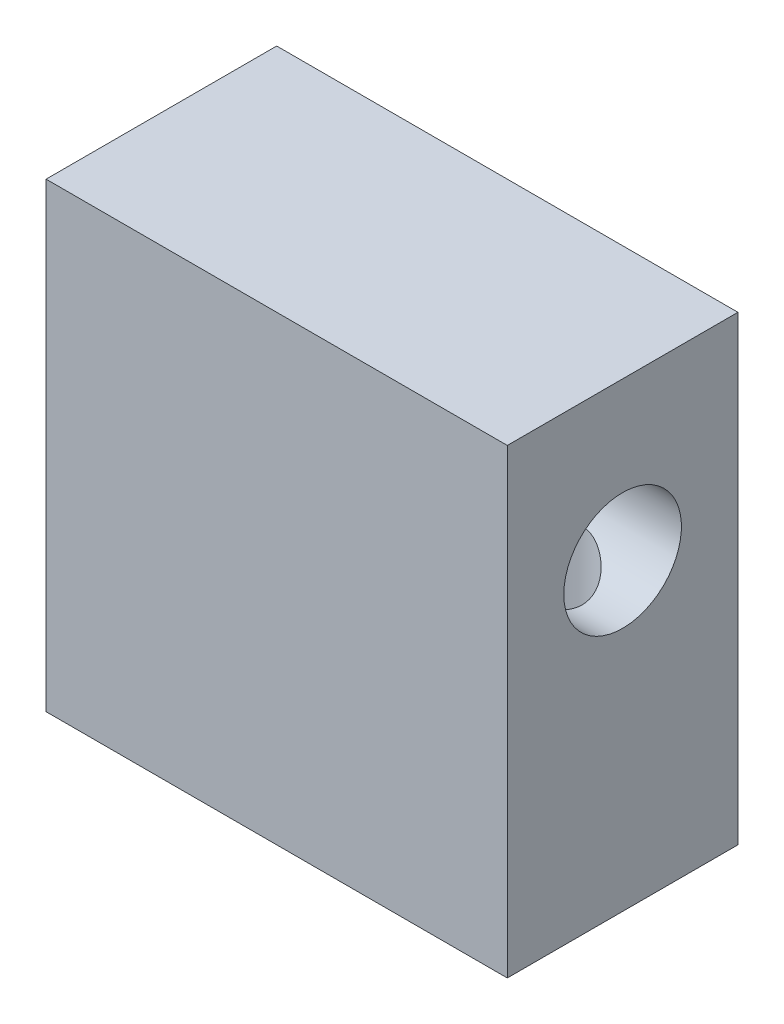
ISO-10303-21;
HEADER;
FILE_DESCRIPTION(('STEP AP214'),'2;1');
FILE_NAME('part.step','',(''),(''),'','','');
FILE_SCHEMA(('AUTOMOTIVE_DESIGN { 1 0 10303 214 1 1 1 1 }'));
ENDSEC;
DATA;
#1=APPLICATION_CONTEXT('core data for automotive mechanical design processes');
#2=APPLICATION_PROTOCOL_DEFINITION('international standard','automotive_design',2000,#1);
#3=PRODUCT_CONTEXT('',#1,'mechanical');
#4=PRODUCT('Part','Part','',(#3));
#5=PRODUCT_RELATED_PRODUCT_CATEGORY('part','',(#4));
#6=PRODUCT_DEFINITION_FORMATION('','',#4);
#7=PRODUCT_DEFINITION_CONTEXT('part definition',#1,'design');
#8=PRODUCT_DEFINITION('design','',#6,#7);
#9=PRODUCT_DEFINITION_SHAPE('','',#8);
#10=(LENGTH_UNIT() NAMED_UNIT(*) SI_UNIT(.MILLI.,.METRE.));
#11=(NAMED_UNIT(*) PLANE_ANGLE_UNIT() SI_UNIT($,.RADIAN.));
#12=(NAMED_UNIT(*) SI_UNIT($,.STERADIAN.) SOLID_ANGLE_UNIT());
#13=UNCERTAINTY_MEASURE_WITH_UNIT(LENGTH_MEASURE(1.E-05),#10,'distance_accuracy_value','');
#14=(GEOMETRIC_REPRESENTATION_CONTEXT(3) GLOBAL_UNCERTAINTY_ASSIGNED_CONTEXT((#13)) GLOBAL_UNIT_ASSIGNED_CONTEXT((#10,
#11,#12)) REPRESENTATION_CONTEXT('',''));
#15=CARTESIAN_POINT('',(0.,0.,0.));
#16=DIRECTION('',(0.,0.,1.));
#17=DIRECTION('',(1.,0.,0.));
#18=AXIS2_PLACEMENT_3D('',#15,#16,#17);
#19=CARTESIAN_POINT('',(0.,0.,12.7));
#20=DIRECTION('',(-1.,0.,0.));
#21=DIRECTION('',(0.,0.,1.));
#22=AXIS2_PLACEMENT_3D('',#19,#20,#21);
#23=PLANE('',#22);
#24=CARTESIAN_POINT('',(0.,16.7386,6.35));
#25=DIRECTION('',(-1.,0.,0.));
#26=DIRECTION('',(0.,0.,1.));
#27=AXIS2_PLACEMENT_3D('',#24,#25,#26);
#28=CIRCLE('',#27,3.2385);
#29=CARTESIAN_POINT('',(0.,16.7386,9.5885));
#30=VERTEX_POINT('',#29);
#31=EDGE_CURVE('E143',#30,#30,#28,.T.);
#32=ORIENTED_EDGE('',*,*,#31,.F.);
#33=EDGE_LOOP('',(#32));
#34=FACE_BOUND('',#33,.T.);
#35=DIRECTION('',(0.,0.,-1.));
#36=VECTOR('',#35,1.);
#37=CARTESIAN_POINT('',(0.,0.,12.7));
#38=LINE('',#37,#36);
#39=CARTESIAN_POINT('',(0.,0.,12.7));
#40=VERTEX_POINT('',#39);
#41=CARTESIAN_POINT('',(0.,0.,0.));
#42=VERTEX_POINT('',#41);
#43=EDGE_CURVE('E182',#40,#42,#38,.T.);
#44=ORIENTED_EDGE('',*,*,#43,.F.);
#45=DIRECTION('',(0.,1.,0.));
#46=VECTOR('',#45,1.);
#47=CARTESIAN_POINT('',(0.,0.,12.7));
#48=LINE('',#47,#46);
#49=CARTESIAN_POINT('',(0.,25.4,12.7));
#50=VERTEX_POINT('',#49);
#51=EDGE_CURVE('E164',#40,#50,#48,.T.);
#52=ORIENTED_EDGE('',*,*,#51,.T.);
#53=DIRECTION('',(0.,0.,-1.));
#54=VECTOR('',#53,1.);
#55=CARTESIAN_POINT('',(0.,25.4,12.7));
#56=LINE('',#55,#54);
#57=CARTESIAN_POINT('',(0.,25.4,0.));
#58=VERTEX_POINT('',#57);
#59=EDGE_CURVE('E176',#50,#58,#56,.T.);
#60=ORIENTED_EDGE('',*,*,#59,.T.);
#61=DIRECTION('',(0.,1.,0.));
#62=VECTOR('',#61,1.);
#63=CARTESIAN_POINT('',(0.,0.,0.));
#64=LINE('',#63,#62);
#65=EDGE_CURVE('E146',#42,#58,#64,.T.);
#66=ORIENTED_EDGE('',*,*,#65,.F.);
#67=EDGE_LOOP('',(#44,#52,#60,#66));
#68=FACE_BOUND('',#67,.T.);
#69=ADVANCED_FACE('F39',(#34,#68),#23,.T.);
#70=CARTESIAN_POINT('',(0.,0.,12.7));
#71=DIRECTION('',(0.,1.,0.));
#72=DIRECTION('',(-1.,0.,0.));
#73=AXIS2_PLACEMENT_3D('',#70,#71,#72);
#74=PLANE('',#73);
#75=CARTESIAN_POINT('',(20.6248,0.,6.35));
#76=DIRECTION('',(0.,-1.,0.));
#77=DIRECTION('',(1.,0.,0.));
#78=AXIS2_PLACEMENT_3D('',#75,#76,#77);
#79=CIRCLE('',#78,2.54);
#80=CARTESIAN_POINT('',(23.1648,0.,6.35));
#81=VERTEX_POINT('',#80);
#82=EDGE_CURVE('E354',#81,#81,#79,.T.);
#83=ORIENTED_EDGE('',*,*,#82,.F.);
#84=EDGE_LOOP('',(#83));
#85=FACE_BOUND('',#84,.T.);
#86=CARTESIAN_POINT('',(4.7498,0.,6.35));
#87=DIRECTION('',(0.,-1.,0.));
#88=DIRECTION('',(1.,0.,0.));
#89=AXIS2_PLACEMENT_3D('',#86,#87,#88);
#90=CIRCLE('',#89,2.54);
#91=CARTESIAN_POINT('',(7.2898,0.,6.35));
#92=VERTEX_POINT('',#91);
#93=EDGE_CURVE('E357',#92,#92,#90,.T.);
#94=ORIENTED_EDGE('',*,*,#93,.F.);
#95=EDGE_LOOP('',(#94));
#96=FACE_BOUND('',#95,.T.);
#97=DIRECTION('',(0.,0.,-1.));
#98=VECTOR('',#97,1.);
#99=CARTESIAN_POINT('',(25.4,0.,12.7));
#100=LINE('',#99,#98);
#101=CARTESIAN_POINT('',(25.4,0.,12.7));
#102=VERTEX_POINT('',#101);
#103=CARTESIAN_POINT('',(25.4,0.,0.));
#104=VERTEX_POINT('',#103);
#105=EDGE_CURVE('E180',#102,#104,#100,.T.);
#106=ORIENTED_EDGE('',*,*,#105,.F.);
#107=DIRECTION('',(1.,0.,0.));
#108=VECTOR('',#107,1.);
#109=CARTESIAN_POINT('',(0.,0.,12.7));
#110=LINE('',#109,#108);
#111=EDGE_CURVE('E173',#40,#102,#110,.T.);
#112=ORIENTED_EDGE('',*,*,#111,.F.);
#113=ORIENTED_EDGE('',*,*,#43,.T.);
#114=DIRECTION('',(1.,0.,0.));
#115=VECTOR('',#114,1.);
#116=CARTESIAN_POINT('',(0.,0.,0.));
#117=LINE('',#116,#115);
#118=EDGE_CURVE('E161',#42,#104,#117,.T.);
#119=ORIENTED_EDGE('',*,*,#118,.T.);
#120=EDGE_LOOP('',(#106,#112,#113,#119));
#121=FACE_BOUND('',#120,.T.);
#122=ADVANCED_FACE('F41',(#85,#96,#121),#74,.F.);
#123=CARTESIAN_POINT('',(25.4,25.4,12.7));
#124=DIRECTION('',(1.,0.,0.));
#125=DIRECTION('',(0.,0.,-1.));
#126=AXIS2_PLACEMENT_3D('',#123,#124,#125);
#127=PLANE('',#126);
#128=CARTESIAN_POINT('',(25.4,16.7386,6.35));
#129=DIRECTION('',(-1.,0.,0.));
#130=DIRECTION('',(0.,0.,1.));
#131=AXIS2_PLACEMENT_3D('',#128,#129,#130);
#132=CIRCLE('',#131,3.2385);
#133=CARTESIAN_POINT('',(25.4,16.7386,9.5885));
#134=VERTEX_POINT('',#133);
#135=EDGE_CURVE('E140',#134,#134,#132,.T.);
#136=ORIENTED_EDGE('',*,*,#135,.T.);
#137=EDGE_LOOP('',(#136));
#138=FACE_BOUND('',#137,.T.);
#139=DIRECTION('',(0.,0.,-1.));
#140=VECTOR('',#139,1.);
#141=CARTESIAN_POINT('',(25.4,25.4,12.7));
#142=LINE('',#141,#140);
#143=CARTESIAN_POINT('',(25.4,25.4,12.7));
#144=VERTEX_POINT('',#143);
#145=CARTESIAN_POINT('',(25.4,25.4,0.));
#146=VERTEX_POINT('',#145);
#147=EDGE_CURVE('E178',#144,#146,#142,.T.);
#148=ORIENTED_EDGE('',*,*,#147,.F.);
#149=DIRECTION('',(0.,-1.,0.));
#150=VECTOR('',#149,1.);
#151=CARTESIAN_POINT('',(25.4,25.4,12.7));
#152=LINE('',#151,#150);
#153=EDGE_CURVE('E170',#144,#102,#152,.T.);
#154=ORIENTED_EDGE('',*,*,#153,.T.);
#155=ORIENTED_EDGE('',*,*,#105,.T.);
#156=DIRECTION('',(0.,-1.,0.));
#157=VECTOR('',#156,1.);
#158=CARTESIAN_POINT('',(25.4,25.4,0.));
#159=LINE('',#158,#157);
#160=EDGE_CURVE('E158',#146,#104,#159,.T.);
#161=ORIENTED_EDGE('',*,*,#160,.F.);
#162=EDGE_LOOP('',(#148,#154,#155,#161));
#163=FACE_BOUND('',#162,.T.);
#164=ADVANCED_FACE('F228',(#138,#163),#127,.T.);
#165=CARTESIAN_POINT('',(25.4,25.4,12.7));
#166=DIRECTION('',(0.,-1.,0.));
#167=DIRECTION('',(1.,0.,0.));
#168=AXIS2_PLACEMENT_3D('',#165,#166,#167);
#169=PLANE('',#168);
#170=DIRECTION('',(-1.,0.,0.));
#171=VECTOR('',#170,1.);
#172=CARTESIAN_POINT('',(25.4,25.4,12.7));
#173=LINE('',#172,#171);
#174=EDGE_CURVE('E167',#144,#50,#173,.T.);
#175=ORIENTED_EDGE('',*,*,#174,.F.);
#176=ORIENTED_EDGE('',*,*,#147,.T.);
#177=DIRECTION('',(-1.,0.,0.));
#178=VECTOR('',#177,1.);
#179=CARTESIAN_POINT('',(25.4,25.4,0.));
#180=LINE('',#179,#178);
#181=EDGE_CURVE('E155',#146,#58,#180,.T.);
#182=ORIENTED_EDGE('',*,*,#181,.T.);
#183=ORIENTED_EDGE('',*,*,#59,.F.);
#184=EDGE_LOOP('',(#175,#176,#182,#183));
#185=FACE_BOUND('',#184,.T.);
#186=ADVANCED_FACE('F234',(#185),#169,.F.);
#187=CARTESIAN_POINT('',(0.,0.,12.7));
#188=DIRECTION('',(0.,0.,-1.));
#189=DIRECTION('',(-1.,0.,0.));
#190=AXIS2_PLACEMENT_3D('',#187,#188,#189);
#191=PLANE('',#190);
#192=ORIENTED_EDGE('',*,*,#51,.F.);
#193=ORIENTED_EDGE('',*,*,#111,.T.);
#194=ORIENTED_EDGE('',*,*,#153,.F.);
#195=ORIENTED_EDGE('',*,*,#174,.T.);
#196=EDGE_LOOP('',(#192,#193,#194,#195));
#197=FACE_BOUND('',#196,.T.);
#198=ADVANCED_FACE('F233',(#197),#191,.F.);
#199=CARTESIAN_POINT('',(0.,0.,0.));
#200=DIRECTION('',(0.,0.,-1.));
#201=DIRECTION('',(-1.,0.,0.));
#202=AXIS2_PLACEMENT_3D('',#199,#200,#201);
#203=PLANE('',#202);
#204=ORIENTED_EDGE('',*,*,#65,.T.);
#205=ORIENTED_EDGE('',*,*,#181,.F.);
#206=ORIENTED_EDGE('',*,*,#160,.T.);
#207=ORIENTED_EDGE('',*,*,#118,.F.);
#208=EDGE_LOOP('',(#204,#205,#206,#207));
#209=FACE_BOUND('',#208,.T.);
#210=ADVANCED_FACE('F119',(#209),#203,.T.);
#211=CARTESIAN_POINT('',(25.4,16.7386,6.35));
#212=DIRECTION('',(-1.,0.,0.));
#213=DIRECTION('',(0.,0.,1.));
#214=AXIS2_PLACEMENT_3D('',#211,#212,#213);
#215=CYLINDRICAL_SURFACE('',#214,3.2385);
#216=CARTESIAN_POINT('',(23.1648,13.5001,6.35));
#217=CARTESIAN_POINT('',(23.1647902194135,13.5001094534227,6.47258871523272));
#218=CARTESIAN_POINT('',(23.155852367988,13.5071323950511,6.59534958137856));
#219=CARTESIAN_POINT('',(23.1206899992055,13.5345972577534,6.83694182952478));
#220=CARTESIAN_POINT('',(23.0944284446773,13.5550679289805,6.95576421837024));
#221=CARTESIAN_POINT('',(23.0264799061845,13.6074844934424,7.18533101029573));
#222=CARTESIAN_POINT('',(22.9848894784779,13.639358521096,7.29612089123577));
#223=CARTESIAN_POINT('',(22.8883129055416,13.7122535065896,7.50832701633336));
#224=CARTESIAN_POINT('',(22.8333264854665,13.7532746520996,7.60974306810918));
#225=CARTESIAN_POINT('',(22.6912800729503,13.8570180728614,7.83474340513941));
#226=CARTESIAN_POINT('',(22.599662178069,13.9223876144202,7.9542244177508));
#227=CARTESIAN_POINT('',(22.3989266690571,14.0593555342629,8.17381920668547));
#228=CARTESIAN_POINT('',(22.2897591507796,14.1309714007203,8.27387590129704));
#229=CARTESIAN_POINT('',(22.1134615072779,14.2385568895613,8.40938708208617));
#230=CARTESIAN_POINT('',(22.0521033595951,14.2747134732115,8.45239078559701));
#231=CARTESIAN_POINT('',(21.9253232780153,14.3459273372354,8.53309189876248));
#232=CARTESIAN_POINT('',(21.8599001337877,14.380984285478,8.57078771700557));
#233=CARTESIAN_POINT('',(21.7251829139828,14.4486776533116,8.64052240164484));
#234=CARTESIAN_POINT('',(21.6559004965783,14.4813207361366,8.67257720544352));
#235=CARTESIAN_POINT('',(21.5133215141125,14.5427817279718,8.73076749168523));
#236=CARTESIAN_POINT('',(21.4400283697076,14.5716028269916,8.75690792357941));
#237=CARTESIAN_POINT('',(21.2761542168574,14.6282332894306,8.8068072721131));
#238=CARTESIAN_POINT('',(21.1848047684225,14.6549667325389,8.82933202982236));
#239=CARTESIAN_POINT('',(20.9977856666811,14.6972363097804,8.86425676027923));
#240=CARTESIAN_POINT('',(20.9021268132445,14.7127989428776,8.87668070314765));
#241=CARTESIAN_POINT('',(20.7079753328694,14.7301612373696,8.89051165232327));
#242=CARTESIAN_POINT('',(20.6094669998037,14.7318584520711,8.8918366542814));
#243=CARTESIAN_POINT('',(20.4137300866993,14.7208680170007,8.88311573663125));
#244=CARTESIAN_POINT('',(20.3165029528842,14.7081653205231,8.87305792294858));
#245=CARTESIAN_POINT('',(20.1089805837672,14.6673279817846,8.83968018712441));
#246=CARTESIAN_POINT('',(19.9995095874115,14.6368142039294,8.81428745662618));
#247=CARTESIAN_POINT('',(19.7881181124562,14.5645827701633,8.75079603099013));
#248=CARTESIAN_POINT('',(19.6862199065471,14.5228336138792,8.71266153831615));
#249=CARTESIAN_POINT('',(19.5176852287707,14.445553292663,8.63733050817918));
#250=CARTESIAN_POINT('',(19.449117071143,14.411516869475,8.60281659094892));
#251=CARTESIAN_POINT('',(19.3160629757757,14.3415460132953,8.52821686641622));
#252=CARTESIAN_POINT('',(19.2515787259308,14.3056108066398,8.48812877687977));
#253=CARTESIAN_POINT('',(19.1266697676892,14.2329873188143,8.40254426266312));
#254=CARTESIAN_POINT('',(19.0662480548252,14.1962985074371,8.35704391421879));
#255=CARTESIAN_POINT('',(18.9496001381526,14.1231617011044,8.26076788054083));
#256=CARTESIAN_POINT('',(18.8933760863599,14.0867138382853,8.20998952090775));
#257=CARTESIAN_POINT('',(18.7292485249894,13.9776975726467,8.04776616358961));
#258=CARTESIAN_POINT('',(18.6281176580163,13.9068078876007,7.92794841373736));
#259=CARTESIAN_POINT('',(18.4928207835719,13.8093216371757,7.73293607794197));
#260=CARTESIAN_POINT('',(18.450478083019,13.778318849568,7.6654349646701));
#261=CARTESIAN_POINT('',(18.3717648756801,13.7200334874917,7.52553063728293));
#262=CARTESIAN_POINT('',(18.3353917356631,13.6927492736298,7.45312960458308));
#263=CARTESIAN_POINT('',(18.2556646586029,13.6324529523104,7.27307045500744));
#264=CARTESIAN_POINT('',(18.2155883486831,13.6016974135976,7.16315442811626));
#265=CARTESIAN_POINT('',(18.1506300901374,13.5515367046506,6.9364828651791));
#266=CARTESIAN_POINT('',(18.125736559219,13.5321228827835,6.81973261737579));
#267=CARTESIAN_POINT('',(18.092552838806,13.5061940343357,6.58191812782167));
#268=CARTESIAN_POINT('',(18.0843345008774,13.4997348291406,6.46083749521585));
#269=CARTESIAN_POINT('',(18.0853063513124,13.5004972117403,6.21878956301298));
#270=CARTESIAN_POINT('',(18.0944959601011,13.5077183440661,6.09782225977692));
#271=CARTESIAN_POINT('',(18.1284563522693,13.534241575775,5.86782532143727));
#272=CARTESIAN_POINT('',(18.1521550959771,13.5527120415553,5.75853561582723));
#273=CARTESIAN_POINT('',(18.2128700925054,13.5996006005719,5.54599710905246));
#274=CARTESIAN_POINT('',(18.249889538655,13.6280210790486,5.44274976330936));
#275=CARTESIAN_POINT('',(18.3390005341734,13.695534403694,5.2362961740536));
#276=CARTESIAN_POINT('',(18.3920417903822,13.735286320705,5.13372009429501));
#277=CARTESIAN_POINT('',(18.509827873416,13.8217879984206,4.93880184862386));
#278=CARTESIAN_POINT('',(18.5745781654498,13.8685410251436,4.84646449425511));
#279=CARTESIAN_POINT('',(18.7278432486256,13.9761421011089,4.65562111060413));
#280=CARTESIAN_POINT('',(18.818530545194,14.0379624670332,4.5594119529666));
#281=CARTESIAN_POINT('',(19.0128588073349,14.163889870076,4.38263168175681));
#282=CARTESIAN_POINT('',(19.1165173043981,14.227999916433,4.30208211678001));
#283=CARTESIAN_POINT('',(19.3322834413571,14.3512823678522,4.15976457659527));
#284=CARTESIAN_POINT('',(19.443966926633,14.4105490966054,4.09743670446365));
#285=CARTESIAN_POINT('',(19.6789450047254,14.5204512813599,3.98914828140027));
#286=CARTESIAN_POINT('',(19.8022144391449,14.5711047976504,3.94315325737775));
#287=CARTESIAN_POINT('',(20.0198959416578,14.642131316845,3.88135548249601));
#288=CARTESIAN_POINT('',(20.111395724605,14.6670231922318,3.8606128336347));
#289=CARTESIAN_POINT('',(20.2983942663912,14.7052517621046,3.82928544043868));
#290=CARTESIAN_POINT('',(20.3938836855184,14.7186140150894,3.81867822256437));
#291=CARTESIAN_POINT('',(20.5870247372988,14.7315120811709,3.80843256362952));
#292=CARTESIAN_POINT('',(20.6846859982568,14.7309631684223,3.80886133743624));
#293=CARTESIAN_POINT('',(20.8782808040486,14.715935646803,3.82081309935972));
#294=CARTESIAN_POINT('',(20.974211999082,14.7014393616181,3.83235016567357));
#295=CARTESIAN_POINT('',(21.1825903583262,14.6565720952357,3.86926605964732));
#296=CARTESIAN_POINT('',(21.2939598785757,14.6233854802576,3.89715460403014));
#297=CARTESIAN_POINT('',(21.5086298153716,14.5460418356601,3.96604651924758));
#298=CARTESIAN_POINT('',(21.6119063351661,14.5018538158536,4.0070870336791));
#299=CARTESIAN_POINT('',(21.7816209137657,14.4211274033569,4.08737611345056));
#300=CARTESIAN_POINT('',(21.8501386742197,14.3860223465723,4.12377195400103));
#301=CARTESIAN_POINT('',(21.9829825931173,14.3141795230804,4.20223469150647));
#302=CARTESIAN_POINT('',(22.0473071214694,14.2774411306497,4.24430377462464));
#303=CARTESIAN_POINT('',(22.1717603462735,14.2034736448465,4.3339656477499));
#304=CARTESIAN_POINT('',(22.2318865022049,14.1662442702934,4.3815617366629));
#305=CARTESIAN_POINT('',(22.3477790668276,14.0922906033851,4.48215577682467));
#306=CARTESIAN_POINT('',(22.4035432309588,14.0555665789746,4.53515647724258));
#307=CARTESIAN_POINT('',(22.565386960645,13.9465206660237,4.70374246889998));
#308=CARTESIAN_POINT('',(22.6644688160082,13.8762840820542,4.82780478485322));
#309=CARTESIAN_POINT('',(22.7959005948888,13.7807146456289,5.02926336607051));
#310=CARTESIAN_POINT('',(22.8368279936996,13.7505031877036,5.09893398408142));
#311=CARTESIAN_POINT('',(22.9123948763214,13.6941405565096,5.24314446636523));
#312=CARTESIAN_POINT('',(22.9470378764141,13.6679871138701,5.3176815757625));
#313=CARTESIAN_POINT('',(23.0210687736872,13.6116831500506,5.50001738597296));
#314=CARTESIAN_POINT('',(23.0573498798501,13.583722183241,5.60979197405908));
#315=CARTESIAN_POINT('',(23.1148025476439,13.5392153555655,5.83526663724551));
#316=CARTESIAN_POINT('',(23.1360129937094,13.5226401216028,5.95095063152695));
#317=CARTESIAN_POINT('',(23.1543142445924,13.5083186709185,6.11467176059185));
#318=CARTESIAN_POINT('',(23.1582398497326,13.5052431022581,6.16158625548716));
#319=CARTESIAN_POINT('',(23.1634849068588,13.5011317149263,6.25565863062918));
#320=CARTESIAN_POINT('',(23.1648037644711,13.5000963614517,6.30281656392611));
#321=CARTESIAN_POINT('',(23.1648,13.5001,6.35));
#322=B_SPLINE_CURVE_WITH_KNOTS('',3,(#216,#217,#218,#219,#220,#221,#222,#223,#224,#225,#226,
#227,#228,#229,#230,#231,#232,#233,#234,#235,#236,#237,#238,#239,#240,#241,#242,#243,#244,#245,
#246,#247,#248,#249,#250,#251,#252,#253,#254,#255,#256,#257,#258,#259,#260,#261,#262,#263,#264,
#265,#266,#267,#268,#269,#270,#271,#272,#273,#274,#275,#276,#277,#278,#279,#280,#281,#282,#283,
#284,#285,#286,#287,#288,#289,#290,#291,#292,#293,#294,#295,#296,#297,#298,#299,#300,#301,#302,
#303,#304,#305,#306,#307,#308,#309,#310,#311,#312,#313,#314,#315,#316,#317,#318,#319,#320,#321),
.UNSPECIFIED.,.T.,.F.,(4,2,2,2,2,2,2,2,2,2,2,2,2,2,2,2,2,2,2,2,2,2,2,2,2,2,2,2,2,2,2,2,2,2,2,2,
2,2,2,2,2,2,2,2,2,2,2,2,2,2,2,2,4),(0.,0.367561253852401,0.735910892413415,1.10197888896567,
1.46805439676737,1.95794198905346,2.44924810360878,2.69861499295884,2.94805648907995,
3.196781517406,3.44529762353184,3.73766586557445,4.02933825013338,4.32316376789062,
4.61729659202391,4.9647246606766,5.31313714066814,5.56475655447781,5.81647929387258,
6.06838565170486,6.32042028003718,6.83343639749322,7.08959948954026,7.34564928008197,
7.70696399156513,8.06800272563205,8.43059386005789,8.79317292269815,9.13174292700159,
9.47039414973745,9.83543500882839,10.200646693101,10.6369354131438,11.0738203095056,
11.4953738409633,11.9160322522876,12.2061816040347,12.4956860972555,12.7869542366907,
13.0785920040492,13.4351554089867,13.7927348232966,14.0479102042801,14.3031841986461,
14.5586113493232,14.8141690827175,15.3316086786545,15.5900406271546,15.848327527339,
16.203647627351,16.5580475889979,16.6994867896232,16.8409582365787),.UNSPECIFIED.);
#323=CARTESIAN_POINT('',(23.1648,13.5001,6.35));
#324=VERTEX_POINT('',#323);
#325=EDGE_CURVE('E43',#324,#324,#322,.T.);
#326=ORIENTED_EDGE('',*,*,#325,.T.);
#327=EDGE_LOOP('',(#326));
#328=FACE_BOUND('',#327,.T.);
#329=DIRECTION('',(-1.,0.,0.));
#330=VECTOR('',#329,1.);
#331=CARTESIAN_POINT('',(25.4,19.05,8.61832808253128));
#332=LINE('',#331,#330);
#333=CARTESIAN_POINT('',(19.4818705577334,19.05,8.61832808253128));
#334=VERTEX_POINT('',#333);
#335=CARTESIAN_POINT('',(21.7677294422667,19.05,8.61832808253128));
#336=VERTEX_POINT('',#335);
#337=EDGE_CURVE('E53',#334,#336,#332,.F.);
#338=ORIENTED_EDGE('',*,*,#337,.F.);
#339=CARTESIAN_POINT('',(23.1648,19.9771,6.34999999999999));
#340=CARTESIAN_POINT('',(23.1647902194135,19.9770905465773,6.22741128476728));
#341=CARTESIAN_POINT('',(23.155852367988,19.970067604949,6.10465041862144));
#342=CARTESIAN_POINT('',(23.1206899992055,19.9426027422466,5.86305817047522));
#343=CARTESIAN_POINT('',(23.0944284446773,19.9221320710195,5.74423578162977));
#344=CARTESIAN_POINT('',(23.0264799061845,19.8697155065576,5.51466898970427));
#345=CARTESIAN_POINT('',(22.9848894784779,19.837841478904,5.40387910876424));
#346=CARTESIAN_POINT('',(22.8883129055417,19.7649464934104,5.19167298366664));
#347=CARTESIAN_POINT('',(22.8333264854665,19.7239253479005,5.09025693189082));
#348=CARTESIAN_POINT('',(22.6912800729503,19.6201819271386,4.86525659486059));
#349=CARTESIAN_POINT('',(22.599662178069,19.5548123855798,4.74577558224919));
#350=CARTESIAN_POINT('',(22.3989266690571,19.4178444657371,4.52618079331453));
#351=CARTESIAN_POINT('',(22.2897591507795,19.3462285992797,4.42612409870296));
#352=CARTESIAN_POINT('',(22.1134615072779,19.2386431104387,4.29061291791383));
#353=CARTESIAN_POINT('',(22.0521033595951,19.2024865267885,4.24760921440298));
#354=CARTESIAN_POINT('',(21.9253232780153,19.1312726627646,4.16690810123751));
#355=CARTESIAN_POINT('',(21.8599001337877,19.096215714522,4.12921228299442));
#356=CARTESIAN_POINT('',(21.7251829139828,19.0285223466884,4.05947759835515));
#357=CARTESIAN_POINT('',(21.6559004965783,18.9958792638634,4.02742279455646));
#358=CARTESIAN_POINT('',(21.5133215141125,18.9344182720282,3.96923250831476));
#359=CARTESIAN_POINT('',(21.4400283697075,18.9055971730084,3.94309207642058));
#360=CARTESIAN_POINT('',(21.2761542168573,18.8489667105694,3.8931927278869));
#361=CARTESIAN_POINT('',(21.1848047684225,18.8222332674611,3.87066797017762));
#362=CARTESIAN_POINT('',(20.9977856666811,18.7799636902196,3.83574323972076));
#363=CARTESIAN_POINT('',(20.9021268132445,18.7644010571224,3.82331929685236));
#364=CARTESIAN_POINT('',(20.7079753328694,18.7470387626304,3.80948834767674));
#365=CARTESIAN_POINT('',(20.6094669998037,18.7453415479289,3.80816334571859));
#366=CARTESIAN_POINT('',(20.4137300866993,18.7563319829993,3.81688426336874));
#367=CARTESIAN_POINT('',(20.3165029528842,18.7690346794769,3.82694207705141));
#368=CARTESIAN_POINT('',(20.1089805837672,18.8098720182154,3.86031981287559));
#369=CARTESIAN_POINT('',(19.9995095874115,18.8403857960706,3.88571254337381));
#370=CARTESIAN_POINT('',(19.7881181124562,18.9126172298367,3.94920396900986));
#371=CARTESIAN_POINT('',(19.6862199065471,18.9543663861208,3.98733846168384));
#372=CARTESIAN_POINT('',(19.5176852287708,19.031646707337,4.06266949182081));
#373=CARTESIAN_POINT('',(19.4491170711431,19.065683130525,4.09718340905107));
#374=CARTESIAN_POINT('',(19.3160629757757,19.1356539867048,4.17178313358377));
#375=CARTESIAN_POINT('',(19.2515787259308,19.1715891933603,4.21187122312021));
#376=CARTESIAN_POINT('',(19.1266697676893,19.2442126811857,4.29745573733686));
#377=CARTESIAN_POINT('',(19.0662480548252,19.2809014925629,4.34295608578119));
#378=CARTESIAN_POINT('',(18.9496001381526,19.3540382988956,4.43923211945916));
#379=CARTESIAN_POINT('',(18.8933760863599,19.3904861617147,4.49001047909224));
#380=CARTESIAN_POINT('',(18.7292485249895,19.4995024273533,4.65223383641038));
#381=CARTESIAN_POINT('',(18.6281176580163,19.5703921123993,4.77205158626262));
#382=CARTESIAN_POINT('',(18.4928207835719,19.6678783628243,4.967063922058));
#383=CARTESIAN_POINT('',(18.450478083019,19.6988811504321,5.03456503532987));
#384=CARTESIAN_POINT('',(18.3717648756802,19.7571665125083,5.17446936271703));
#385=CARTESIAN_POINT('',(18.3353917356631,19.7844507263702,5.2468703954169));
#386=CARTESIAN_POINT('',(18.2556646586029,19.8447470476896,5.42692954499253));
#387=CARTESIAN_POINT('',(18.2155883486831,19.8755025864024,5.53684557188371));
#388=CARTESIAN_POINT('',(18.1506300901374,19.9256632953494,5.76351713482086));
#389=CARTESIAN_POINT('',(18.125736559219,19.9450771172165,5.88026738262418));
#390=CARTESIAN_POINT('',(18.092552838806,19.9710059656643,6.11808187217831));
#391=CARTESIAN_POINT('',(18.0843345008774,19.9774651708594,6.23916250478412));
#392=CARTESIAN_POINT('',(18.0853063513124,19.9767027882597,6.48121043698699));
#393=CARTESIAN_POINT('',(18.0944959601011,19.969481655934,6.60217774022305));
#394=CARTESIAN_POINT('',(18.1284563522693,19.942958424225,6.8321746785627));
#395=CARTESIAN_POINT('',(18.1521550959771,19.9244879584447,6.94146438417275));
#396=CARTESIAN_POINT('',(18.2128700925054,19.8775993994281,7.15400289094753));
#397=CARTESIAN_POINT('',(18.249889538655,19.8491789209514,7.25725023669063));
#398=CARTESIAN_POINT('',(18.3390005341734,19.781665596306,7.46370382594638));
#399=CARTESIAN_POINT('',(18.3920417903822,19.741913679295,7.56627990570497));
#400=CARTESIAN_POINT('',(18.509827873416,19.6554120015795,7.76119815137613));
#401=CARTESIAN_POINT('',(18.5745781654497,19.6086589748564,7.85353550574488));
#402=CARTESIAN_POINT('',(18.7278432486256,19.5010578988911,8.04437888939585));
#403=CARTESIAN_POINT('',(18.818530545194,19.4392375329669,8.14058804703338));
#404=CARTESIAN_POINT('',(19.0128588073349,19.313310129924,8.31736831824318));
#405=CARTESIAN_POINT('',(19.116517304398,19.249200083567,8.39791788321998));
#406=CARTESIAN_POINT('',(19.332283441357,19.1259176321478,8.54023542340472));
#407=CARTESIAN_POINT('',(19.4439669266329,19.0666509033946,8.60256329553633));
#408=CARTESIAN_POINT('',(19.6789450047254,18.9567487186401,8.71085171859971));
#409=CARTESIAN_POINT('',(19.8022144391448,18.9060952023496,8.75684674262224));
#410=CARTESIAN_POINT('',(20.0198959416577,18.8350686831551,8.81864451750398));
#411=CARTESIAN_POINT('',(20.111395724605,18.8101768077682,8.83938716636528));
#412=CARTESIAN_POINT('',(20.2983942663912,18.7719482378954,8.87071455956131));
#413=CARTESIAN_POINT('',(20.3938836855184,18.7585859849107,8.88132177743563));
#414=CARTESIAN_POINT('',(20.5870247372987,18.7456879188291,8.89156743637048));
#415=CARTESIAN_POINT('',(20.6846859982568,18.7462368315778,8.89113866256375));
#416=CARTESIAN_POINT('',(20.8782808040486,18.761264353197,8.87918690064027));
#417=CARTESIAN_POINT('',(20.974211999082,18.7757606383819,8.86764983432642));
#418=CARTESIAN_POINT('',(21.1825903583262,18.8206279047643,8.83073394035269));
#419=CARTESIAN_POINT('',(21.2939598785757,18.8538145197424,8.80284539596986));
#420=CARTESIAN_POINT('',(21.5086298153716,18.9311581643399,8.73395348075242));
#421=CARTESIAN_POINT('',(21.611906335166,18.9753461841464,8.6929129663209));
#422=CARTESIAN_POINT('',(21.7816209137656,19.0560725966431,8.61262388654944));
#423=CARTESIAN_POINT('',(21.8501386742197,19.0911776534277,8.57622804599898));
#424=CARTESIAN_POINT('',(21.9829825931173,19.1630204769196,8.49776530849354));
#425=CARTESIAN_POINT('',(22.0473071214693,19.1997588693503,8.45569622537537));
#426=CARTESIAN_POINT('',(22.1717603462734,19.2737263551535,8.36603435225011));
#427=CARTESIAN_POINT('',(22.2318865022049,19.3109557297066,8.31843826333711));
#428=CARTESIAN_POINT('',(22.3477790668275,19.3849093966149,8.21784422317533));
#429=CARTESIAN_POINT('',(22.4035432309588,19.4216334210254,8.16484352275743));
#430=CARTESIAN_POINT('',(22.565386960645,19.5306793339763,7.99625753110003));
#431=CARTESIAN_POINT('',(22.6644688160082,19.6009159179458,7.8721952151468));
#432=CARTESIAN_POINT('',(22.7959005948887,19.6964853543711,7.67073663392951));
#433=CARTESIAN_POINT('',(22.8368279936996,19.7266968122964,7.60106601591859));
#434=CARTESIAN_POINT('',(22.9123948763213,19.7830594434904,7.45685553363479));
#435=CARTESIAN_POINT('',(22.9470378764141,19.8092128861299,7.38231842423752));
#436=CARTESIAN_POINT('',(23.0210687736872,19.8655168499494,7.19998261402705));
#437=CARTESIAN_POINT('',(23.0573498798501,19.893477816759,7.09020802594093));
#438=CARTESIAN_POINT('',(23.1148025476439,19.9379846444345,6.86473336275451));
#439=CARTESIAN_POINT('',(23.1360129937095,19.9545598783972,6.74904936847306));
#440=CARTESIAN_POINT('',(23.1543142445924,19.9688813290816,6.58532823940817));
#441=CARTESIAN_POINT('',(23.1582398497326,19.9719568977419,6.53841374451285));
#442=CARTESIAN_POINT('',(23.1634849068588,19.9760682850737,6.44434136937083));
#443=CARTESIAN_POINT('',(23.1648037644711,19.9771036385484,6.3971834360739));
#444=CARTESIAN_POINT('',(23.1648,19.9771,6.34999999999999));
#445=B_SPLINE_CURVE_WITH_KNOTS('',3,(#339,#340,#341,#342,#343,#344,#345,#346,#347,#348,#349,
#350,#351,#352,#353,#354,#355,#356,#357,#358,#359,#360,#361,#362,#363,#364,#365,#366,#367,#368,
#369,#370,#371,#372,#373,#374,#375,#376,#377,#378,#379,#380,#381,#382,#383,#384,#385,#386,#387,
#388,#389,#390,#391,#392,#393,#394,#395,#396,#397,#398,#399,#400,#401,#402,#403,#404,#405,#406,
#407,#408,#409,#410,#411,#412,#413,#414,#415,#416,#417,#418,#419,#420,#421,#422,#423,#424,#425,
#426,#427,#428,#429,#430,#431,#432,#433,#434,#435,#436,#437,#438,#439,#440,#441,#442,#443,#444),
.UNSPECIFIED.,.T.,.F.,(4,2,2,2,2,2,2,2,2,2,2,2,2,2,2,2,2,2,2,2,2,2,2,2,2,2,2,2,2,2,2,2,2,2,2,2,
2,2,2,2,2,2,2,2,2,2,2,2,2,2,2,2,4),(0.,0.367561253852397,0.735910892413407,1.10197888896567,
1.46805439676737,1.95794198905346,2.44924810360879,2.69861499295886,2.94805648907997,
3.19678151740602,3.44529762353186,3.73766586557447,4.02933825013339,4.32316376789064,
4.61729659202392,4.96472466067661,5.31313714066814,5.56475655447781,5.81647929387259,
6.06838565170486,6.32042028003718,6.83343639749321,7.08959948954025,7.34564928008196,
7.70696399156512,8.06800272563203,8.43059386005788,8.79317292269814,9.13174292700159,
9.47039414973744,9.83543500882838,10.200646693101,10.6369354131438,11.0738203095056,
11.4953738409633,11.9160322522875,12.2061816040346,12.4956860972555,12.7869542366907,
13.0785920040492,13.4351554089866,13.7927348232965,14.04791020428,14.3031841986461,
14.5586113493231,14.8141690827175,15.3316086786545,15.5900406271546,15.848327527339,
16.203647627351,16.5580475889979,16.6994867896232,16.8409582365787),.UNSPECIFIED.);
#446=EDGE_CURVE('E11',#334,#336,#445,.T.);
#447=ORIENTED_EDGE('',*,*,#446,.T.);
#448=EDGE_LOOP('',(#338,#447));
#449=FACE_BOUND('',#448,.T.);
#450=DIRECTION('',(-1.,0.,0.));
#451=VECTOR('',#450,1.);
#452=CARTESIAN_POINT('',(25.4,19.05,4.08167191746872));
#453=LINE('',#452,#451);
#454=CARTESIAN_POINT('',(21.7677294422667,19.05,4.08167191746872));
#455=VERTEX_POINT('',#454);
#456=CARTESIAN_POINT('',(19.4818705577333,19.05,4.08167191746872));
#457=VERTEX_POINT('',#456);
#458=EDGE_CURVE('E124',#455,#457,#453,.T.);
#459=ORIENTED_EDGE('',*,*,#458,.F.);
#460=EDGE_CURVE('E55',#455,#457,#445,.T.);
#461=ORIENTED_EDGE('',*,*,#460,.T.);
#462=EDGE_LOOP('',(#459,#461));
#463=FACE_BOUND('',#462,.T.);
#464=CARTESIAN_POINT('',(7.2898,13.5001,6.34999999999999));
#465=CARTESIAN_POINT('',(7.28979021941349,13.5001094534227,6.47258871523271));
#466=CARTESIAN_POINT('',(7.28085236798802,13.5071323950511,6.59534958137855));
#467=CARTESIAN_POINT('',(7.24568999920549,13.5345972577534,6.83694182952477));
#468=CARTESIAN_POINT('',(7.21942844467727,13.5550679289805,6.95576421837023));
#469=CARTESIAN_POINT('',(7.15147990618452,13.6074844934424,7.18533101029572));
#470=CARTESIAN_POINT('',(7.1098894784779,13.639358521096,7.29612089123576));
#471=CARTESIAN_POINT('',(7.01331290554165,13.7122535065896,7.50832701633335));
#472=CARTESIAN_POINT('',(6.95832648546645,13.7532746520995,7.60974306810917));
#473=CARTESIAN_POINT('',(6.81628007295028,13.8570180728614,7.8347434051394));
#474=CARTESIAN_POINT('',(6.72466217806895,13.9223876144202,7.95422441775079));
#475=CARTESIAN_POINT('',(6.5239266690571,14.0593555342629,8.17381920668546));
#476=CARTESIAN_POINT('',(6.41475915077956,14.1309714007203,8.27387590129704));
#477=CARTESIAN_POINT('',(6.23846150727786,14.2385568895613,8.40938708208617));
#478=CARTESIAN_POINT('',(6.17710335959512,14.2747134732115,8.45239078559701));
#479=CARTESIAN_POINT('',(6.05032327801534,14.3459273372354,8.53309189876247));
#480=CARTESIAN_POINT('',(5.98490013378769,14.380984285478,8.57078771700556));
#481=CARTESIAN_POINT('',(5.8501829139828,14.4486776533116,8.64052240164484));
#482=CARTESIAN_POINT('',(5.78090049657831,14.4813207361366,8.67257720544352));
#483=CARTESIAN_POINT('',(5.6383215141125,14.5427817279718,8.73076749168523));
#484=CARTESIAN_POINT('',(5.56502836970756,14.5716028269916,8.75690792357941));
#485=CARTESIAN_POINT('',(5.40115421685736,14.6282332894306,8.80680727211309));
#486=CARTESIAN_POINT('',(5.30980476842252,14.6549667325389,8.82933202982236));
#487=CARTESIAN_POINT('',(5.12278566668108,14.6972363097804,8.86425676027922));
#488=CARTESIAN_POINT('',(5.02712681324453,14.7127989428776,8.87668070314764));
#489=CARTESIAN_POINT('',(4.83297533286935,14.7301612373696,8.89051165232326));
#490=CARTESIAN_POINT('',(4.73446699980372,14.7318584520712,8.89183665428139));
#491=CARTESIAN_POINT('',(4.53873008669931,14.7208680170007,8.88311573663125));
#492=CARTESIAN_POINT('',(4.44150295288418,14.7081653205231,8.87305792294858));
#493=CARTESIAN_POINT('',(4.23398058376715,14.6673279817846,8.83968018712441));
#494=CARTESIAN_POINT('',(4.12450958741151,14.6368142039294,8.81428745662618));
#495=CARTESIAN_POINT('',(3.91311811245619,14.5645827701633,8.75079603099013));
#496=CARTESIAN_POINT('',(3.81121990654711,14.5228336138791,8.71266153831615));
#497=CARTESIAN_POINT('',(3.64268522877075,14.445553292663,8.63733050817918));
#498=CARTESIAN_POINT('',(3.57411707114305,14.411516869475,8.60281659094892));
#499=CARTESIAN_POINT('',(3.44106297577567,14.3415460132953,8.52821686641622));
#500=CARTESIAN_POINT('',(3.37657872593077,14.3056108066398,8.48812877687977));
#501=CARTESIAN_POINT('',(3.25166976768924,14.2329873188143,8.40254426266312));
#502=CARTESIAN_POINT('',(3.19124805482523,14.1962985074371,8.35704391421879));
#503=CARTESIAN_POINT('',(3.07460013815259,14.1231617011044,8.26076788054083));
#504=CARTESIAN_POINT('',(3.01837608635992,14.0867138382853,8.20998952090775));
#505=CARTESIAN_POINT('',(2.85424852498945,13.9776975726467,8.04776616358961));
#506=CARTESIAN_POINT('',(2.75311765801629,13.9068078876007,7.92794841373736));
#507=CARTESIAN_POINT('',(2.61782078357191,13.8093216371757,7.73293607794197));
#508=CARTESIAN_POINT('',(2.57547808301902,13.778318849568,7.6654349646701));
#509=CARTESIAN_POINT('',(2.49676487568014,13.7200334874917,7.52553063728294));
#510=CARTESIAN_POINT('',(2.46039173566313,13.6927492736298,7.45312960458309));
#511=CARTESIAN_POINT('',(2.38066465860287,13.6324529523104,7.27307045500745));
#512=CARTESIAN_POINT('',(2.34058834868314,13.6016974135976,7.16315442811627));
#513=CARTESIAN_POINT('',(2.27563009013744,13.5515367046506,6.93648286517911));
#514=CARTESIAN_POINT('',(2.250736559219,13.5321228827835,6.8197326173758));
#515=CARTESIAN_POINT('',(2.21755283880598,13.5061940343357,6.58191812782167));
#516=CARTESIAN_POINT('',(2.2093345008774,13.4997348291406,6.46083749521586));
#517=CARTESIAN_POINT('',(2.21030635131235,13.5004972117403,6.21878956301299));
#518=CARTESIAN_POINT('',(2.21949596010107,13.5077183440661,6.09782225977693));
#519=CARTESIAN_POINT('',(2.25345635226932,13.5342415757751,5.86782532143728));
#520=CARTESIAN_POINT('',(2.27715509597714,13.5527120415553,5.75853561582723));
#521=CARTESIAN_POINT('',(2.33787009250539,13.5996006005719,5.54599710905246));
#522=CARTESIAN_POINT('',(2.37488953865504,13.6280210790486,5.44274976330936));
#523=CARTESIAN_POINT('',(2.46400053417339,13.6955344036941,5.23629617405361));
#524=CARTESIAN_POINT('',(2.5170417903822,13.735286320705,5.13372009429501));
#525=CARTESIAN_POINT('',(2.63482787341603,13.8217879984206,4.93880184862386));
#526=CARTESIAN_POINT('',(2.69957816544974,13.8685410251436,4.84646449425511));
#527=CARTESIAN_POINT('',(2.85284324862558,13.9761421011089,4.65562111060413));
#528=CARTESIAN_POINT('',(2.94353054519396,14.0379624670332,4.5594119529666));
#529=CARTESIAN_POINT('',(3.13785880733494,14.163889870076,4.38263168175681));
#530=CARTESIAN_POINT('',(3.24151730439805,14.227999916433,4.30208211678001));
#531=CARTESIAN_POINT('',(3.45728344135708,14.3512823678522,4.15976457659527));
#532=CARTESIAN_POINT('',(3.56896692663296,14.4105490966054,4.09743670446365));
#533=CARTESIAN_POINT('',(3.80394500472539,14.5204512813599,3.98914828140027));
#534=CARTESIAN_POINT('',(3.92721443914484,14.5711047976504,3.94315325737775));
#535=CARTESIAN_POINT('',(4.14489594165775,14.642131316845,3.88135548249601));
#536=CARTESIAN_POINT('',(4.236395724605,14.6670231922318,3.8606128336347));
#537=CARTESIAN_POINT('',(4.42339426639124,14.7052517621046,3.82928544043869));
#538=CARTESIAN_POINT('',(4.51888368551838,14.7186140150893,3.81867822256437));
#539=CARTESIAN_POINT('',(4.71202473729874,14.7315120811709,3.80843256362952));
#540=CARTESIAN_POINT('',(4.80968599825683,14.7309631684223,3.80886133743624));
#541=CARTESIAN_POINT('',(5.00328080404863,14.715935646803,3.82081309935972));
#542=CARTESIAN_POINT('',(5.09921199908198,14.7014393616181,3.83235016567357));
#543=CARTESIAN_POINT('',(5.30759035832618,14.6565720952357,3.86926605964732));
#544=CARTESIAN_POINT('',(5.41895987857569,14.6233854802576,3.89715460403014));
#545=CARTESIAN_POINT('',(5.6336298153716,14.5460418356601,3.96604651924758));
#546=CARTESIAN_POINT('',(5.73690633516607,14.5018538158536,4.00708703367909));
#547=CARTESIAN_POINT('',(5.90662091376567,14.4211274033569,4.08737611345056));
#548=CARTESIAN_POINT('',(5.97513867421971,14.3860223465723,4.12377195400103));
#549=CARTESIAN_POINT('',(6.10798259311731,14.3141795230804,4.20223469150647));
#550=CARTESIAN_POINT('',(6.17230712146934,14.2774411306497,4.24430377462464));
#551=CARTESIAN_POINT('',(6.29676034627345,14.2034736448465,4.3339656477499));
#552=CARTESIAN_POINT('',(6.35688650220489,14.1662442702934,4.38156173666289));
#553=CARTESIAN_POINT('',(6.47277906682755,14.0922906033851,4.48215577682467));
#554=CARTESIAN_POINT('',(6.52854323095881,14.0555665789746,4.53515647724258));
#555=CARTESIAN_POINT('',(6.69038696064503,13.9465206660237,4.70374246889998));
#556=CARTESIAN_POINT('',(6.78946881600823,13.8762840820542,4.82780478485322));
#557=CARTESIAN_POINT('',(6.92090059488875,13.7807146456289,5.02926336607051));
#558=CARTESIAN_POINT('',(6.96182799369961,13.7505031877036,5.09893398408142));
#559=CARTESIAN_POINT('',(7.03739487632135,13.6941405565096,5.24314446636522));
#560=CARTESIAN_POINT('',(7.07203787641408,13.6679871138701,5.3176815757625));
#561=CARTESIAN_POINT('',(7.1460687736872,13.6116831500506,5.50001738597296));
#562=CARTESIAN_POINT('',(7.18234987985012,13.583722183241,5.60979197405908));
#563=CARTESIAN_POINT('',(7.23980254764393,13.5392153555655,5.8352666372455));
#564=CARTESIAN_POINT('',(7.26101299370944,13.5226401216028,5.95095063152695));
#565=CARTESIAN_POINT('',(7.27931424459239,13.5083186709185,6.11467176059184));
#566=CARTESIAN_POINT('',(7.28323984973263,13.5052431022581,6.16158625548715));
#567=CARTESIAN_POINT('',(7.28848490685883,13.5011317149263,6.25565863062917));
#568=CARTESIAN_POINT('',(7.28980376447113,13.5000963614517,6.3028165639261));
#569=CARTESIAN_POINT('',(7.2898,13.5001,6.34999999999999));
#570=B_SPLINE_CURVE_WITH_KNOTS('',3,(#464,#465,#466,#467,#468,#469,#470,#471,#472,#473,#474,
#475,#476,#477,#478,#479,#480,#481,#482,#483,#484,#485,#486,#487,#488,#489,#490,#491,#492,#493,
#494,#495,#496,#497,#498,#499,#500,#501,#502,#503,#504,#505,#506,#507,#508,#509,#510,#511,#512,
#513,#514,#515,#516,#517,#518,#519,#520,#521,#522,#523,#524,#525,#526,#527,#528,#529,#530,#531,
#532,#533,#534,#535,#536,#537,#538,#539,#540,#541,#542,#543,#544,#545,#546,#547,#548,#549,#550,
#551,#552,#553,#554,#555,#556,#557,#558,#559,#560,#561,#562,#563,#564,#565,#566,#567,#568,#569),
.UNSPECIFIED.,.T.,.F.,(4,2,2,2,2,2,2,2,2,2,2,2,2,2,2,2,2,2,2,2,2,2,2,2,2,2,2,2,2,2,2,2,2,2,2,2,
2,2,2,2,2,2,2,2,2,2,2,2,2,2,2,2,4),(0.,0.367561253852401,0.735910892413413,1.10197888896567,
1.46805439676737,1.95794198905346,2.44924810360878,2.69861499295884,2.94805648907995,
3.196781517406,3.44529762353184,3.73766586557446,4.02933825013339,4.32316376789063,
4.61729659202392,4.9647246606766,5.31313714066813,5.56475655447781,5.81647929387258,
6.06838565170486,6.32042028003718,6.83343639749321,7.08959948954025,7.34564928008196,
7.70696399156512,8.06800272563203,8.43059386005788,8.79317292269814,9.13174292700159,
9.47039414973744,9.83543500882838,10.200646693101,10.6369354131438,11.0738203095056,
11.4953738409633,11.9160322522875,12.2061816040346,12.4956860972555,12.7869542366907,
13.0785920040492,13.4351554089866,13.7927348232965,14.04791020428,14.3031841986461,
14.5586113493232,14.8141690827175,15.3316086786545,15.5900406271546,15.848327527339,
16.203647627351,16.5580475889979,16.6994867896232,16.8409582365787),.UNSPECIFIED.);
#571=CARTESIAN_POINT('',(7.2898,13.5001,6.34999999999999));
#572=VERTEX_POINT('',#571);
#573=EDGE_CURVE('E128',#572,#572,#570,.T.);
#574=ORIENTED_EDGE('',*,*,#573,.T.);
#575=EDGE_LOOP('',(#574));
#576=FACE_BOUND('',#575,.T.);
#577=DIRECTION('',(-1.,0.,0.));
#578=VECTOR('',#577,1.);
#579=CARTESIAN_POINT('',(25.4,19.05,8.61832808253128));
#580=LINE('',#579,#578);
#581=CARTESIAN_POINT('',(3.60687055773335,19.05,8.61832808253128));
#582=VERTEX_POINT('',#581);
#583=CARTESIAN_POINT('',(5.89272944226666,19.05,8.61832808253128));
#584=VERTEX_POINT('',#583);
#585=EDGE_CURVE('E132',#582,#584,#580,.F.);
#586=ORIENTED_EDGE('',*,*,#585,.F.);
#587=CARTESIAN_POINT('',(7.28980000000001,19.9771,6.34999999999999));
#588=CARTESIAN_POINT('',(7.2897902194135,19.9770905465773,6.22741128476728));
#589=CARTESIAN_POINT('',(7.28085236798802,19.9700676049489,6.10465041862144));
#590=CARTESIAN_POINT('',(7.24568999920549,19.9426027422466,5.86305817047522));
#591=CARTESIAN_POINT('',(7.21942844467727,19.9221320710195,5.74423578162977));
#592=CARTESIAN_POINT('',(7.15147990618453,19.8697155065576,5.51466898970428));
#593=CARTESIAN_POINT('',(7.1098894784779,19.837841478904,5.40387910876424));
#594=CARTESIAN_POINT('',(7.01331290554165,19.7649464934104,5.19167298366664));
#595=CARTESIAN_POINT('',(6.95832648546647,19.7239253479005,5.09025693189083));
#596=CARTESIAN_POINT('',(6.8162800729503,19.6201819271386,4.86525659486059));
#597=CARTESIAN_POINT('',(6.72466217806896,19.5548123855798,4.7457755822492));
#598=CARTESIAN_POINT('',(6.52392666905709,19.4178444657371,4.52618079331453));
#599=CARTESIAN_POINT('',(6.41475915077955,19.3462285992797,4.42612409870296));
#600=CARTESIAN_POINT('',(6.23846150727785,19.2386431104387,4.29061291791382));
#601=CARTESIAN_POINT('',(6.17710335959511,19.2024865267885,4.24760921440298));
#602=CARTESIAN_POINT('',(6.05032327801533,19.1312726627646,4.16690810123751));
#603=CARTESIAN_POINT('',(5.98490013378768,19.096215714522,4.12921228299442));
#604=CARTESIAN_POINT('',(5.85018291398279,19.0285223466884,4.05947759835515));
#605=CARTESIAN_POINT('',(5.78090049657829,18.9958792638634,4.02742279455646));
#606=CARTESIAN_POINT('',(5.63832151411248,18.9344182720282,3.96923250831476));
#607=CARTESIAN_POINT('',(5.56502836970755,18.9055971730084,3.94309207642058));
#608=CARTESIAN_POINT('',(5.40115421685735,18.8489667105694,3.8931927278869));
#609=CARTESIAN_POINT('',(5.30980476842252,18.8222332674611,3.87066797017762));
#610=CARTESIAN_POINT('',(5.12278566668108,18.7799636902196,3.83574323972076));
#611=CARTESIAN_POINT('',(5.02712681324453,18.7644010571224,3.82331929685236));
#612=CARTESIAN_POINT('',(4.83297533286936,18.7470387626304,3.80948834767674));
#613=CARTESIAN_POINT('',(4.73446699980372,18.7453415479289,3.8081633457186));
#614=CARTESIAN_POINT('',(4.53873008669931,18.7563319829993,3.81688426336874));
#615=CARTESIAN_POINT('',(4.44150295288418,18.7690346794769,3.82694207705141));
#616=CARTESIAN_POINT('',(4.23398058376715,18.8098720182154,3.86031981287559));
#617=CARTESIAN_POINT('',(4.12450958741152,18.8403857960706,3.88571254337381));
#618=CARTESIAN_POINT('',(3.91311811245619,18.9126172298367,3.94920396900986));
#619=CARTESIAN_POINT('',(3.8112199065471,18.9543663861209,3.98733846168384));
#620=CARTESIAN_POINT('',(3.64268522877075,19.031646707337,4.06266949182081));
#621=CARTESIAN_POINT('',(3.57411707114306,19.065683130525,4.09718340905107));
#622=CARTESIAN_POINT('',(3.44106297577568,19.1356539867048,4.17178313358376));
#623=CARTESIAN_POINT('',(3.37657872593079,19.1715891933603,4.21187122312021));
#624=CARTESIAN_POINT('',(3.25166976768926,19.2442126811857,4.29745573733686));
#625=CARTESIAN_POINT('',(3.19124805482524,19.2809014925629,4.34295608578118));
#626=CARTESIAN_POINT('',(3.0746001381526,19.3540382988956,4.43923211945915));
#627=CARTESIAN_POINT('',(3.01837608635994,19.3904861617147,4.49001047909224));
#628=CARTESIAN_POINT('',(2.85424852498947,19.4995024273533,4.65223383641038));
#629=CARTESIAN_POINT('',(2.75311765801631,19.5703921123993,4.77205158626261));
#630=CARTESIAN_POINT('',(2.61782078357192,19.6678783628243,4.967063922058));
#631=CARTESIAN_POINT('',(2.57547808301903,19.6988811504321,5.03456503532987));
#632=CARTESIAN_POINT('',(2.49676487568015,19.7571665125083,5.17446936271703));
#633=CARTESIAN_POINT('',(2.46039173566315,19.7844507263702,5.2468703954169));
#634=CARTESIAN_POINT('',(2.38066465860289,19.8447470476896,5.42692954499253));
#635=CARTESIAN_POINT('',(2.34058834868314,19.8755025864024,5.53684557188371));
#636=CARTESIAN_POINT('',(2.27563009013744,19.9256632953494,5.76351713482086));
#637=CARTESIAN_POINT('',(2.250736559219,19.9450771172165,5.88026738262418));
#638=CARTESIAN_POINT('',(2.21755283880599,19.9710059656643,6.11808187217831));
#639=CARTESIAN_POINT('',(2.2093345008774,19.9774651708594,6.23916250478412));
#640=CARTESIAN_POINT('',(2.21030635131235,19.9767027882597,6.48121043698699));
#641=CARTESIAN_POINT('',(2.21949596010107,19.9694816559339,6.60217774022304));
#642=CARTESIAN_POINT('',(2.25345635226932,19.942958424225,6.8321746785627));
#643=CARTESIAN_POINT('',(2.27715509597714,19.9244879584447,6.94146438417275));
#644=CARTESIAN_POINT('',(2.3378700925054,19.8775993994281,7.15400289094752));
#645=CARTESIAN_POINT('',(2.37488953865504,19.8491789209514,7.25725023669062));
#646=CARTESIAN_POINT('',(2.4640005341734,19.781665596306,7.46370382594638));
#647=CARTESIAN_POINT('',(2.5170417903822,19.741913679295,7.56627990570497));
#648=CARTESIAN_POINT('',(2.63482787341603,19.6554120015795,7.76119815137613));
#649=CARTESIAN_POINT('',(2.69957816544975,19.6086589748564,7.85353550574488));
#650=CARTESIAN_POINT('',(2.85284324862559,19.5010578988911,8.04437888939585));
#651=CARTESIAN_POINT('',(2.94353054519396,19.4392375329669,8.14058804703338));
#652=CARTESIAN_POINT('',(3.13785880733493,19.313310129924,8.31736831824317));
#653=CARTESIAN_POINT('',(3.24151730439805,19.249200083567,8.39791788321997));
#654=CARTESIAN_POINT('',(3.45728344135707,19.1259176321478,8.54023542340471));
#655=CARTESIAN_POINT('',(3.56896692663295,19.0666509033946,8.60256329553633));
#656=CARTESIAN_POINT('',(3.80394500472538,18.9567487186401,8.71085171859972));
#657=CARTESIAN_POINT('',(3.92721443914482,18.9060952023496,8.75684674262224));
#658=CARTESIAN_POINT('',(4.14489594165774,18.835068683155,8.81864451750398));
#659=CARTESIAN_POINT('',(4.23639572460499,18.8101768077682,8.83938716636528));
#660=CARTESIAN_POINT('',(4.42339426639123,18.7719482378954,8.8707145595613));
#661=CARTESIAN_POINT('',(4.51888368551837,18.7585859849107,8.88132177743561));
#662=CARTESIAN_POINT('',(4.71202473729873,18.7456879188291,8.89156743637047));
#663=CARTESIAN_POINT('',(4.80968599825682,18.7462368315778,8.89113866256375));
#664=CARTESIAN_POINT('',(5.00328080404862,18.761264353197,8.87918690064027));
#665=CARTESIAN_POINT('',(5.09921199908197,18.7757606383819,8.86764983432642));
#666=CARTESIAN_POINT('',(5.30759035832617,18.8206279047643,8.83073394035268));
#667=CARTESIAN_POINT('',(5.41895987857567,18.8538145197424,8.80284539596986));
#668=CARTESIAN_POINT('',(5.63362981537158,18.9311581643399,8.73395348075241));
#669=CARTESIAN_POINT('',(5.73690633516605,18.9753461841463,8.6929129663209));
#670=CARTESIAN_POINT('',(5.90662091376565,19.0560725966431,8.61262388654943));
#671=CARTESIAN_POINT('',(5.97513867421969,19.0911776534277,8.57622804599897));
#672=CARTESIAN_POINT('',(6.1079825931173,19.1630204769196,8.49776530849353));
#673=CARTESIAN_POINT('',(6.17230712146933,19.1997588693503,8.45569622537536));
#674=CARTESIAN_POINT('',(6.29676034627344,19.2737263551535,8.3660343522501));
#675=CARTESIAN_POINT('',(6.35688650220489,19.3109557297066,8.3184382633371));
#676=CARTESIAN_POINT('',(6.47277906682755,19.3849093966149,8.21784422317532));
#677=CARTESIAN_POINT('',(6.52854323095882,19.4216334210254,8.16484352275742));
#678=CARTESIAN_POINT('',(6.69038696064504,19.5306793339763,7.99625753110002));
#679=CARTESIAN_POINT('',(6.78946881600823,19.6009159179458,7.87219521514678));
#680=CARTESIAN_POINT('',(6.92090059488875,19.6964853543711,7.67073663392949));
#681=CARTESIAN_POINT('',(6.9618279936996,19.7266968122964,7.60106601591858));
#682=CARTESIAN_POINT('',(7.03739487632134,19.7830594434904,7.45685553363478));
#683=CARTESIAN_POINT('',(7.07203787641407,19.80921288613,7.38231842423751));
#684=CARTESIAN_POINT('',(7.1460687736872,19.8655168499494,7.19998261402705));
#685=CARTESIAN_POINT('',(7.18234987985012,19.893477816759,7.09020802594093));
#686=CARTESIAN_POINT('',(7.23980254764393,19.9379846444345,6.8647333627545));
#687=CARTESIAN_POINT('',(7.26101299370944,19.9545598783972,6.74904936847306));
#688=CARTESIAN_POINT('',(7.27931424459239,19.9688813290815,6.58532823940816));
#689=CARTESIAN_POINT('',(7.28323984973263,19.9719568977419,6.53841374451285));
#690=CARTESIAN_POINT('',(7.28848490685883,19.9760682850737,6.44434136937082));
#691=CARTESIAN_POINT('',(7.28980376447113,19.9771036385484,6.39718343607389));
#692=CARTESIAN_POINT('',(7.28980000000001,19.9771,6.34999999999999));
#693=B_SPLINE_CURVE_WITH_KNOTS('',3,(#587,#588,#589,#590,#591,#592,#593,#594,#595,#596,#597,
#598,#599,#600,#601,#602,#603,#604,#605,#606,#607,#608,#609,#610,#611,#612,#613,#614,#615,#616,
#617,#618,#619,#620,#621,#622,#623,#624,#625,#626,#627,#628,#629,#630,#631,#632,#633,#634,#635,
#636,#637,#638,#639,#640,#641,#642,#643,#644,#645,#646,#647,#648,#649,#650,#651,#652,#653,#654,
#655,#656,#657,#658,#659,#660,#661,#662,#663,#664,#665,#666,#667,#668,#669,#670,#671,#672,#673,
#674,#675,#676,#677,#678,#679,#680,#681,#682,#683,#684,#685,#686,#687,#688,#689,#690,#691,#692),
.UNSPECIFIED.,.T.,.F.,(4,2,2,2,2,2,2,2,2,2,2,2,2,2,2,2,2,2,2,2,2,2,2,2,2,2,2,2,2,2,2,2,2,2,2,2,
2,2,2,2,2,2,2,2,2,2,2,2,2,2,2,2,4),(0.,0.367561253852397,0.735910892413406,1.10197888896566,
1.46805439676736,1.95794198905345,2.44924810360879,2.69861499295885,2.94805648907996,
3.19678151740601,3.44529762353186,3.73766586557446,4.02933825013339,4.32316376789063,
4.61729659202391,4.9647246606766,5.31313714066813,5.5647565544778,5.81647929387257,
6.06838565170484,6.32042028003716,6.83343639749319,7.08959948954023,7.34564928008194,
7.70696399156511,8.06800272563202,8.43059386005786,8.79317292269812,9.13174292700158,
9.47039414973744,9.83543500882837,10.200646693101,10.6369354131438,11.0738203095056,
11.4953738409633,11.9160322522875,12.2061816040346,12.4956860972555,12.7869542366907,
13.0785920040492,13.4351554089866,13.7927348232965,14.04791020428,14.3031841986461,
14.5586113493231,14.8141690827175,15.3316086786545,15.5900406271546,15.848327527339,
16.203647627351,16.5580475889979,16.6994867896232,16.8409582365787),.UNSPECIFIED.);
#694=EDGE_CURVE('E191',#582,#584,#693,.T.);
#695=ORIENTED_EDGE('',*,*,#694,.T.);
#696=EDGE_LOOP('',(#586,#695));
#697=FACE_BOUND('',#696,.T.);
#698=DIRECTION('',(-1.,0.,0.));
#699=VECTOR('',#698,1.);
#700=CARTESIAN_POINT('',(25.4,19.05,4.08167191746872));
#701=LINE('',#700,#699);
#702=CARTESIAN_POINT('',(5.89272944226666,19.05,4.08167191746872));
#703=VERTEX_POINT('',#702);
#704=CARTESIAN_POINT('',(3.60687055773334,19.05,4.08167191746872));
#705=VERTEX_POINT('',#704);
#706=EDGE_CURVE('E136',#703,#705,#701,.T.);
#707=ORIENTED_EDGE('',*,*,#706,.F.);
#708=EDGE_CURVE('E185',#703,#705,#693,.T.);
#709=ORIENTED_EDGE('',*,*,#708,.T.);
#710=EDGE_LOOP('',(#707,#709));
#711=FACE_BOUND('',#710,.T.);
#712=ORIENTED_EDGE('',*,*,#135,.F.);
#713=EDGE_LOOP('',(#712));
#714=FACE_BOUND('',#713,.T.);
#715=ORIENTED_EDGE('',*,*,#31,.T.);
#716=EDGE_LOOP('',(#715));
#717=FACE_BOUND('',#716,.T.);
#718=ADVANCED_FACE('F115',(#328,#449,#463,#576,#697,#711,#714,#717),#215,.F.);
#719=CARTESIAN_POINT('',(4.7498,19.05,6.34999999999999));
#720=DIRECTION('',(0.,-1.,0.));
#721=DIRECTION('',(1.,0.,0.));
#722=AXIS2_PLACEMENT_3D('',#719,#720,#721);
#723=PLANE('',#722);
#724=ORIENTED_EDGE('',*,*,#706,.T.);
#725=CARTESIAN_POINT('',(4.7498,19.05,6.34999999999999));
#726=DIRECTION('',(0.,-1.,0.));
#727=DIRECTION('',(1.,0.,0.));
#728=AXIS2_PLACEMENT_3D('',#725,#726,#727);
#729=CIRCLE('',#728,2.54);
#730=EDGE_CURVE('E359',#705,#703,#729,.T.);
#731=ORIENTED_EDGE('',*,*,#730,.T.);
#732=EDGE_LOOP('',(#724,#731));
#733=FACE_BOUND('',#732,.T.);
#734=ADVANCED_FACE('F118',(#733),#723,.T.);
#735=CARTESIAN_POINT('',(4.7498,19.05,6.34999999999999));
#736=DIRECTION('',(0.,-1.,0.));
#737=DIRECTION('',(1.,0.,0.));
#738=AXIS2_PLACEMENT_3D('',#735,#736,#737);
#739=CYLINDRICAL_SURFACE('',#738,2.54);
#740=ORIENTED_EDGE('',*,*,#730,.F.);
#741=ORIENTED_EDGE('',*,*,#708,.F.);
#742=EDGE_LOOP('',(#740,#741));
#743=FACE_BOUND('',#742,.T.);
#744=ADVANCED_FACE('F194',(#743),#739,.F.);
#745=ORIENTED_EDGE('',*,*,#585,.T.);
#746=EDGE_CURVE('E148',#584,#582,#729,.T.);
#747=ORIENTED_EDGE('',*,*,#746,.T.);
#748=EDGE_LOOP('',(#745,#747));
#749=FACE_BOUND('',#748,.T.);
#750=ADVANCED_FACE('F198',(#749),#723,.T.);
#751=ORIENTED_EDGE('',*,*,#746,.F.);
#752=ORIENTED_EDGE('',*,*,#694,.F.);
#753=EDGE_LOOP('',(#751,#752));
#754=FACE_BOUND('',#753,.T.);
#755=ADVANCED_FACE('F200',(#754),#739,.F.);
#756=ORIENTED_EDGE('',*,*,#93,.T.);
#757=EDGE_LOOP('',(#756));
#758=FACE_BOUND('',#757,.T.);
#759=ORIENTED_EDGE('',*,*,#573,.F.);
#760=EDGE_LOOP('',(#759));
#761=FACE_BOUND('',#760,.T.);
#762=ADVANCED_FACE('F201',(#758,#761),#739,.F.);
#763=CARTESIAN_POINT('',(20.6248,19.05,6.34999999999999));
#764=DIRECTION('',(0.,-1.,0.));
#765=DIRECTION('',(1.,0.,0.));
#766=AXIS2_PLACEMENT_3D('',#763,#764,#765);
#767=PLANE('',#766);
#768=ORIENTED_EDGE('',*,*,#458,.T.);
#769=CARTESIAN_POINT('',(20.6248,19.05,6.34999999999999));
#770=DIRECTION('',(0.,-1.,0.));
#771=DIRECTION('',(1.,0.,0.));
#772=AXIS2_PLACEMENT_3D('',#769,#770,#771);
#773=CIRCLE('',#772,2.54);
#774=EDGE_CURVE('E68',#457,#455,#773,.T.);
#775=ORIENTED_EDGE('',*,*,#774,.T.);
#776=EDGE_LOOP('',(#768,#775));
#777=FACE_BOUND('',#776,.T.);
#778=ADVANCED_FACE('F214',(#777),#767,.T.);
#779=CARTESIAN_POINT('',(20.6248,19.05,6.34999999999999));
#780=DIRECTION('',(0.,-1.,0.));
#781=DIRECTION('',(1.,0.,0.));
#782=AXIS2_PLACEMENT_3D('',#779,#780,#781);
#783=CYLINDRICAL_SURFACE('',#782,2.54);
#784=ORIENTED_EDGE('',*,*,#774,.F.);
#785=ORIENTED_EDGE('',*,*,#460,.F.);
#786=EDGE_LOOP('',(#784,#785));
#787=FACE_BOUND('',#786,.T.);
#788=ADVANCED_FACE('F210',(#787),#783,.F.);
#789=ORIENTED_EDGE('',*,*,#337,.T.);
#790=EDGE_CURVE('E61',#336,#334,#773,.T.);
#791=ORIENTED_EDGE('',*,*,#790,.T.);
#792=EDGE_LOOP('',(#789,#791));
#793=FACE_BOUND('',#792,.T.);
#794=ADVANCED_FACE('F110',(#793),#767,.T.);
#795=ORIENTED_EDGE('',*,*,#790,.F.);
#796=ORIENTED_EDGE('',*,*,#446,.F.);
#797=EDGE_LOOP('',(#795,#796));
#798=FACE_BOUND('',#797,.T.);
#799=ADVANCED_FACE('F113',(#798),#783,.F.);
#800=ORIENTED_EDGE('',*,*,#82,.T.);
#801=EDGE_LOOP('',(#800));
#802=FACE_BOUND('',#801,.T.);
#803=ORIENTED_EDGE('',*,*,#325,.F.);
#804=EDGE_LOOP('',(#803));
#805=FACE_BOUND('',#804,.T.);
#806=ADVANCED_FACE('F216',(#802,#805),#783,.F.);
#807=CLOSED_SHELL('',(#69,#122,#164,#186,#198,#210,#718,#734,#744,#750,#755,#762,#778,#788,#794,
#799,#806));
#808=MANIFOLD_SOLID_BREP('B2',#807);
#809=ADVANCED_BREP_SHAPE_REPRESENTATION('',(#18,#808),#14);
#810=SHAPE_DEFINITION_REPRESENTATION(#9,#809);
ENDSEC;
END-ISO-10303-21;
